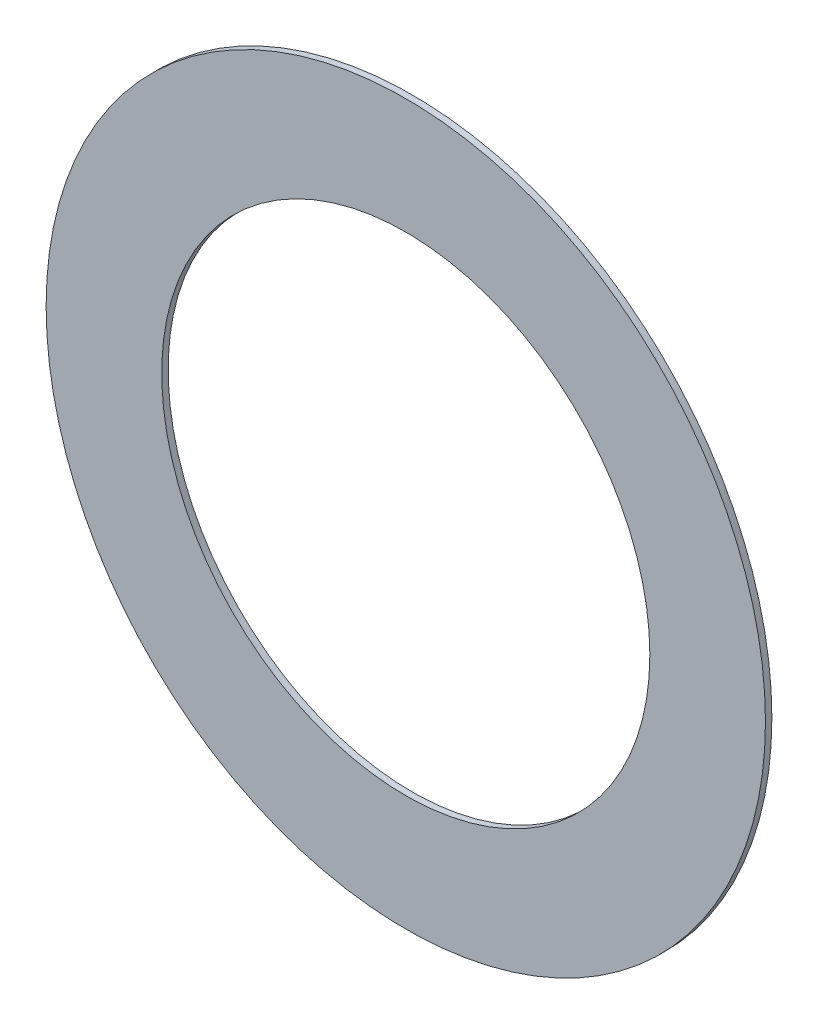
from build123d import *

# Parameters (mm, degrees)
ESQUISSE1_W = 0.25
ESQUISSE1_H = 4.5


with BuildPart() as part:
    # Esquisse1 → Base-R_volution (revolve)
    with BuildSketch(Plane(origin=(0, 0, 0), x_dir=(0, 0, -1), z_dir=(1, 0, 0)), mode=Mode.PRIVATE) as base_r_volution_sk:
        with Locations((0, 11.75)):
            Rectangle(ESQUISSE1_W, ESQUISSE1_H)
    revolve(base_r_volution_sk.sketch.rotate(Axis((0, 0, 0), (0, 0, -1)), 90), axis=Axis((0, 0, 0), (0, 0, -1)))


solid = part.part
